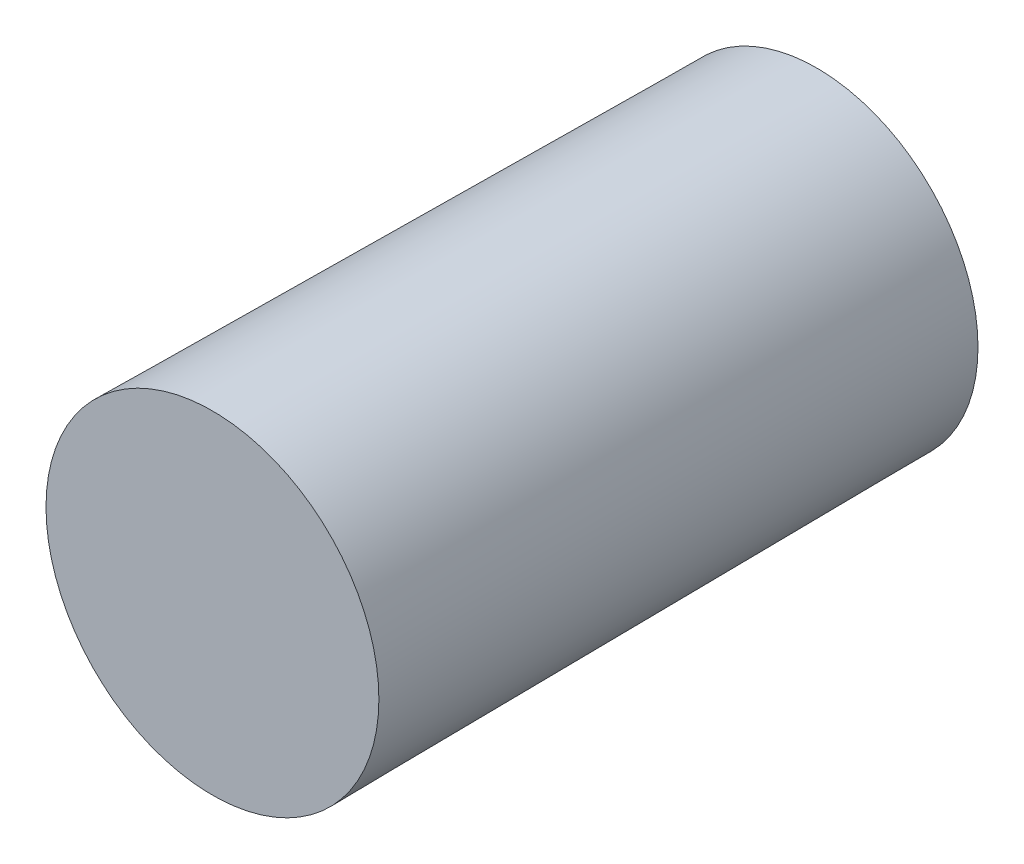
ISO-10303-21;
HEADER;
FILE_DESCRIPTION(('STEP AP214'),'2;1');
FILE_NAME('part.step','',(''),(''),'','','');
FILE_SCHEMA(('AUTOMOTIVE_DESIGN { 1 0 10303 214 1 1 1 1 }'));
ENDSEC;
DATA;
#1=APPLICATION_CONTEXT('core data for automotive mechanical design processes');
#2=APPLICATION_PROTOCOL_DEFINITION('international standard','automotive_design',2000,#1);
#3=PRODUCT_CONTEXT('',#1,'mechanical');
#4=PRODUCT('Part','Part','',(#3));
#5=PRODUCT_RELATED_PRODUCT_CATEGORY('part','',(#4));
#6=PRODUCT_DEFINITION_FORMATION('','',#4);
#7=PRODUCT_DEFINITION_CONTEXT('part definition',#1,'design');
#8=PRODUCT_DEFINITION('design','',#6,#7);
#9=PRODUCT_DEFINITION_SHAPE('','',#8);
#10=(LENGTH_UNIT() NAMED_UNIT(*) SI_UNIT(.MILLI.,.METRE.));
#11=(NAMED_UNIT(*) PLANE_ANGLE_UNIT() SI_UNIT($,.RADIAN.));
#12=(NAMED_UNIT(*) SI_UNIT($,.STERADIAN.) SOLID_ANGLE_UNIT());
#13=UNCERTAINTY_MEASURE_WITH_UNIT(LENGTH_MEASURE(1.E-05),#10,'distance_accuracy_value','');
#14=(GEOMETRIC_REPRESENTATION_CONTEXT(3) GLOBAL_UNCERTAINTY_ASSIGNED_CONTEXT((#13)) GLOBAL_UNIT_ASSIGNED_CONTEXT((#10,
#11,#12)) REPRESENTATION_CONTEXT('',''));
#15=CARTESIAN_POINT('',(0.,0.,0.));
#16=DIRECTION('',(0.,0.,1.));
#17=DIRECTION('',(1.,0.,0.));
#18=AXIS2_PLACEMENT_3D('',#15,#16,#17);
#19=CARTESIAN_POINT('',(1.11022302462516E-13,1.66533453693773E-13,-1.66533453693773E-13));
#20=DIRECTION('',(0.,0.,1.));
#21=DIRECTION('',(1.00000000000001,0.,0.));
#22=AXIS2_PLACEMENT_3D('',#19,#20,#21);
#23=CONICAL_SURFACE('',#22,4.,0.00872664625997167);
#24=CARTESIAN_POINT('',(0.,1.11022302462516E-13,15.0000000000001));
#25=DIRECTION('',(0.,0.,1.));
#26=DIRECTION('',(1.00000000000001,0.,0.));
#27=AXIS2_PLACEMENT_3D('',#24,#25,#26);
#28=CIRCLE('',#27,4.13090301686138);
#29=CARTESIAN_POINT('',(4.13090301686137,1.50922448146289E-13,15.));
#30=VERTEX_POINT('',#29);
#31=EDGE_CURVE('E10',#30,#30,#28,.T.);
#32=ORIENTED_EDGE('',*,*,#31,.F.);
#33=EDGE_LOOP('',(#32));
#34=FACE_BOUND('',#33,.T.);
#35=CARTESIAN_POINT('',(1.11022302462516E-13,1.66533453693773E-13,-1.66533453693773E-13));
#36=DIRECTION('',(0.,0.,1.));
#37=DIRECTION('',(1.00000000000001,0.,0.));
#38=AXIS2_PLACEMENT_3D('',#35,#36,#37);
#39=CIRCLE('',#38,4.);
#40=CARTESIAN_POINT('',(4.00000000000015,2.05169214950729E-13,-1.87072579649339E-13));
#41=VERTEX_POINT('',#40);
#42=EDGE_CURVE('E48',#41,#41,#39,.T.);
#43=ORIENTED_EDGE('',*,*,#42,.T.);
#44=EDGE_LOOP('',(#43));
#45=FACE_BOUND('',#44,.T.);
#46=ADVANCED_FACE('F42',(#34,#45),#23,.T.);
#47=CARTESIAN_POINT('',(0.,1.11022302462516E-13,15.0000000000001));
#48=DIRECTION('',(0.,0.,1.));
#49=DIRECTION('',(1.00000000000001,0.,0.));
#50=AXIS2_PLACEMENT_3D('',#47,#48,#49);
#51=PLANE('',#50);
#52=ORIENTED_EDGE('',*,*,#31,.T.);
#53=EDGE_LOOP('',(#52));
#54=FACE_BOUND('',#53,.T.);
#55=ADVANCED_FACE('F57',(#54),#51,.T.);
#56=CARTESIAN_POINT('',(1.11022302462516E-13,1.66533453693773E-13,-1.66533453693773E-13));
#57=DIRECTION('',(0.,0.,1.));
#58=DIRECTION('',(1.00000000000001,0.,0.));
#59=AXIS2_PLACEMENT_3D('',#56,#57,#58);
#60=PLANE('',#59);
#61=ORIENTED_EDGE('',*,*,#42,.F.);
#62=EDGE_LOOP('',(#61));
#63=FACE_BOUND('',#62,.T.);
#64=ADVANCED_FACE('F55',(#63),#60,.F.);
#65=CLOSED_SHELL('',(#46,#55,#64));
#66=MANIFOLD_SOLID_BREP('B2',#65);
#67=ADVANCED_BREP_SHAPE_REPRESENTATION('',(#18,#66),#14);
#68=SHAPE_DEFINITION_REPRESENTATION(#9,#67);
ENDSEC;
END-ISO-10303-21;
